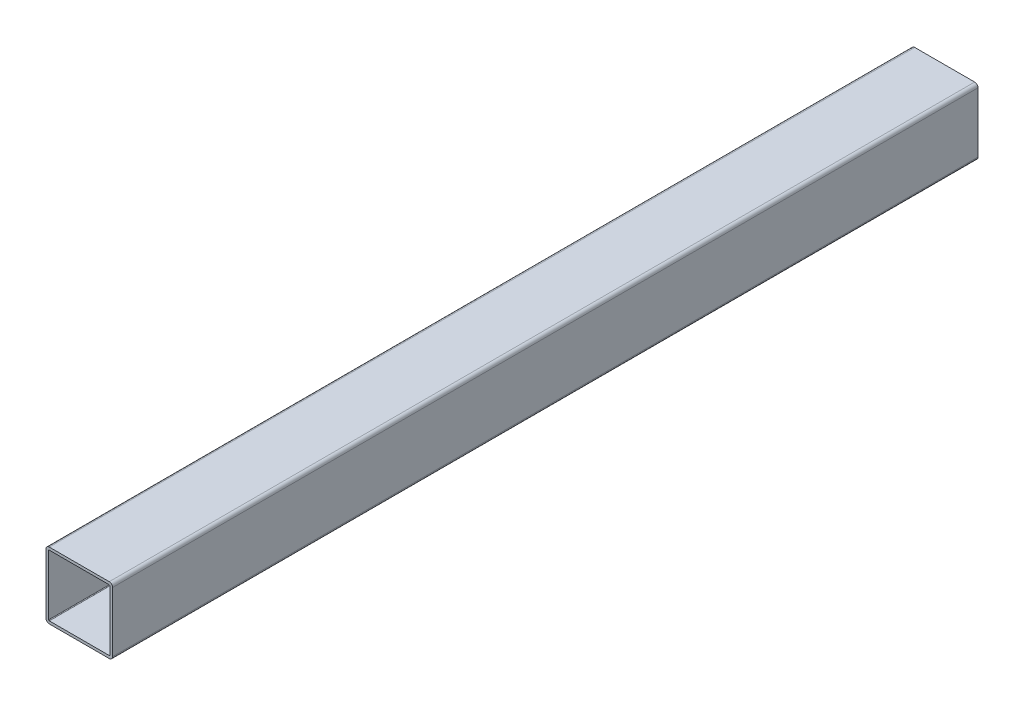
from build123d import *

# Parameters (mm, degrees)
BASE_EXTRUSION_DEPTH    = 1300
ESQUISSE2_R             = 2.5
ENL_V_MAT_EXTRU_1_DEPTH = 6


with BuildPart() as part:
    # Esquisse1 → Base-Extrusion (new body)
    with BuildSketch(Plane.XY):
        with BuildLine():
            Line((5, 0), (95, 0))
            ThreePointArc((95, 0), (98.535533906, -1.464466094), (100, -5))
            Line((100, -5), (100, -95))
            ThreePointArc((100, -95), (98.535533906, -98.535533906), (95, -100))
            Line((95, -100), (5, -100))
            ThreePointArc((5, -100), (1.464466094, -98.535533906), (0, -95))
            Line((0, -95), (0, -5))
            ThreePointArc((0, -5), (1.464466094, -1.464466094), (5, 0))
        make_face()
        with BuildLine():
            Line((5, -4), (95, -4))
            ThreePointArc((95, -4), (95.707106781, -4.292893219), (96, -5))
            Line((96, -5), (96, -95))
            ThreePointArc((96, -95), (95.707106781, -95.707106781), (95, -96))
            Line((95, -96), (5, -96))
            ThreePointArc((5, -96), (4.292893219, -95.707106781), (4, -95))
            Line((4, -95), (4, -5))
            ThreePointArc((4, -5), (4.292893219, -4.292893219), (5, -4))
        make_face(mode=Mode.SUBTRACT)
    extrude(amount=BASE_EXTRUSION_DEPTH)

    # Esquisse2 → Enl_v. mat.-Extru.1 (cut)
    with BuildSketch(Plane.ZY):
        with Locations(Location((300, -50, 0), (0, 0, 270))):
            Circle(ESQUISSE2_R)
        with Locations(Location((1000, -50, 0), (0, 0, 270))):
            Circle(ESQUISSE2_R)
    extrude(amount=-ENL_V_MAT_EXTRU_1_DEPTH, mode=Mode.SUBTRACT)


solid = part.part
